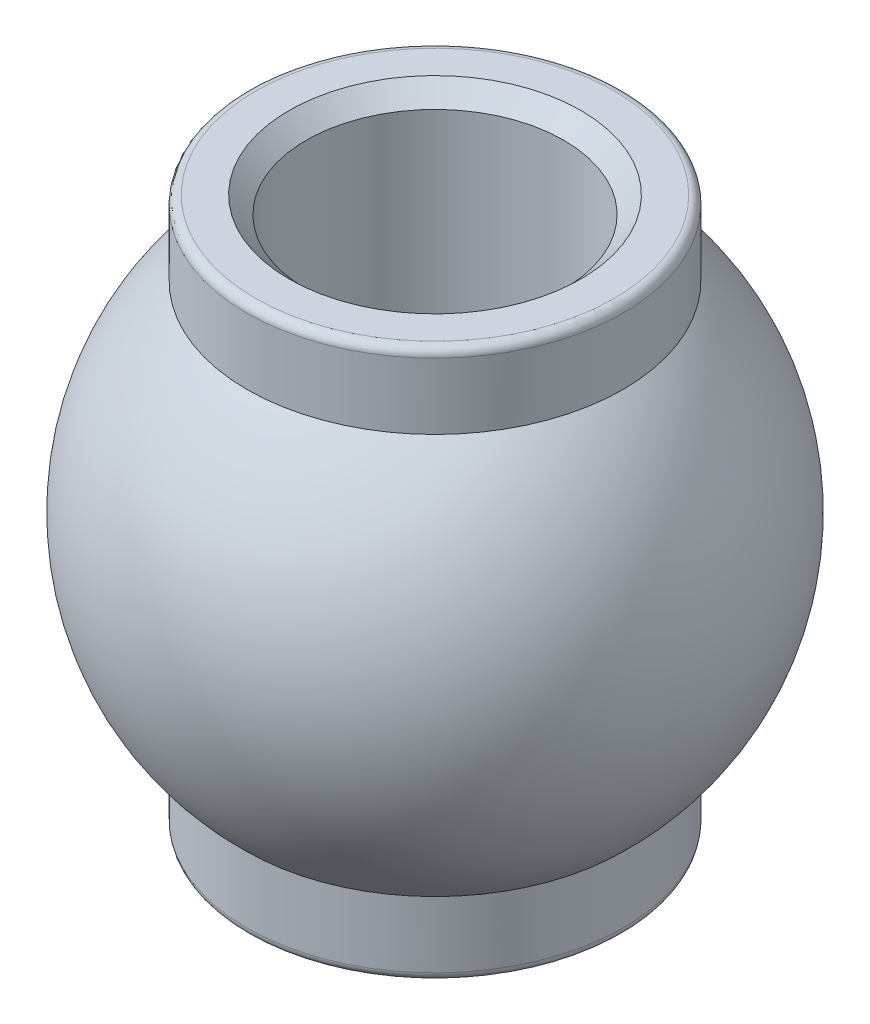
ISO-10303-21;
HEADER;
FILE_DESCRIPTION(('STEP AP214'),'2;1');
FILE_NAME('part.step','',(''),(''),'','','');
FILE_SCHEMA(('AUTOMOTIVE_DESIGN { 1 0 10303 214 1 1 1 1 }'));
ENDSEC;
DATA;
#1=APPLICATION_CONTEXT('core data for automotive mechanical design processes');
#2=APPLICATION_PROTOCOL_DEFINITION('international standard','automotive_design',2000,#1);
#3=PRODUCT_CONTEXT('',#1,'mechanical');
#4=PRODUCT('Part','Part','',(#3));
#5=PRODUCT_RELATED_PRODUCT_CATEGORY('part','',(#4));
#6=PRODUCT_DEFINITION_FORMATION('','',#4);
#7=PRODUCT_DEFINITION_CONTEXT('part definition',#1,'design');
#8=PRODUCT_DEFINITION('design','',#6,#7);
#9=PRODUCT_DEFINITION_SHAPE('','',#8);
#10=(LENGTH_UNIT() NAMED_UNIT(*) SI_UNIT(.MILLI.,.METRE.));
#11=(NAMED_UNIT(*) PLANE_ANGLE_UNIT() SI_UNIT($,.RADIAN.));
#12=(NAMED_UNIT(*) SI_UNIT($,.STERADIAN.) SOLID_ANGLE_UNIT());
#13=UNCERTAINTY_MEASURE_WITH_UNIT(LENGTH_MEASURE(1.E-05),#10,'distance_accuracy_value','');
#14=(GEOMETRIC_REPRESENTATION_CONTEXT(3) GLOBAL_UNCERTAINTY_ASSIGNED_CONTEXT((#13)) GLOBAL_UNIT_ASSIGNED_CONTEXT((#10,
#11,#12)) REPRESENTATION_CONTEXT('',''));
#15=CARTESIAN_POINT('',(0.,0.,0.));
#16=DIRECTION('',(0.,0.,1.));
#17=DIRECTION('',(1.,0.,0.));
#18=AXIS2_PLACEMENT_3D('',#15,#16,#17);
#19=CARTESIAN_POINT('',(7.50000000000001,-16.,0.));
#20=DIRECTION('',(0.,1.,0.));
#21=DIRECTION('',(0.,0.,1.));
#22=AXIS2_PLACEMENT_3D('',#19,#20,#21);
#23=PLANE('',#22);
#24=CARTESIAN_POINT('',(0.,-16.,0.));
#25=DIRECTION('',(0.,1.,0.));
#26=DIRECTION('',(0.,0.,1.));
#27=AXIS2_PLACEMENT_3D('',#24,#25,#26);
#28=CIRCLE('',#27,8.50000000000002);
#29=CARTESIAN_POINT('',(0.,-16.,8.50000000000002));
#30=VERTEX_POINT('',#29);
#31=EDGE_CURVE('E10',#30,#30,#28,.T.);
#32=ORIENTED_EDGE('',*,*,#31,.T.);
#33=EDGE_LOOP('',(#32));
#34=FACE_BOUND('',#33,.T.);
#35=CARTESIAN_POINT('',(0.,-16.,0.));
#36=DIRECTION('',(0.,1.,0.));
#37=DIRECTION('',(0.,0.,1.));
#38=AXIS2_PLACEMENT_3D('',#35,#36,#37);
#39=CIRCLE('',#38,10.45);
#40=CARTESIAN_POINT('',(0.,-16.,10.45));
#41=VERTEX_POINT('',#40);
#42=EDGE_CURVE('E61',#41,#41,#39,.T.);
#43=ORIENTED_EDGE('',*,*,#42,.F.);
#44=EDGE_LOOP('',(#43));
#45=FACE_BOUND('',#44,.T.);
#46=ADVANCED_FACE('F27',(#34,#45),#23,.F.);
#47=CARTESIAN_POINT('',(0.,27.,0.));
#48=DIRECTION('',(0.,1.,0.));
#49=DIRECTION('',(0.,0.,1.));
#50=AXIS2_PLACEMENT_3D('',#47,#48,#49);
#51=CYLINDRICAL_SURFACE('',#50,7.5);
#52=CARTESIAN_POINT('',(0.,15.,0.));
#53=DIRECTION('',(0.,-1.,0.));
#54=DIRECTION('',(0.,0.,-1.));
#55=AXIS2_PLACEMENT_3D('',#52,#53,#54);
#56=CIRCLE('',#55,7.5);
#57=CARTESIAN_POINT('',(0.,15.,-7.5));
#58=VERTEX_POINT('',#57);
#59=EDGE_CURVE('E37',#58,#58,#56,.F.);
#60=ORIENTED_EDGE('',*,*,#59,.T.);
#61=EDGE_LOOP('',(#60));
#62=FACE_BOUND('',#61,.T.);
#63=CARTESIAN_POINT('',(0.,-15.,0.));
#64=DIRECTION('',(0.,1.,0.));
#65=DIRECTION('',(0.,0.,1.));
#66=AXIS2_PLACEMENT_3D('',#63,#64,#65);
#67=CIRCLE('',#66,7.5);
#68=CARTESIAN_POINT('',(0.,-15.,7.5));
#69=VERTEX_POINT('',#68);
#70=EDGE_CURVE('E41',#69,#69,#67,.F.);
#71=ORIENTED_EDGE('',*,*,#70,.T.);
#72=EDGE_LOOP('',(#71));
#73=FACE_BOUND('',#72,.T.);
#74=ADVANCED_FACE('F68',(#62,#73),#51,.F.);
#75=CARTESIAN_POINT('',(7.5,16.,0.));
#76=DIRECTION('',(0.,-1.,0.));
#77=DIRECTION('',(0.,0.,-1.));
#78=AXIS2_PLACEMENT_3D('',#75,#76,#77);
#79=PLANE('',#78);
#80=CARTESIAN_POINT('',(0.,16.,0.));
#81=DIRECTION('',(0.,-1.,0.));
#82=DIRECTION('',(0.,0.,-1.));
#83=AXIS2_PLACEMENT_3D('',#80,#81,#82);
#84=CIRCLE('',#83,8.50000000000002);
#85=CARTESIAN_POINT('',(0.,16.,-8.50000000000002));
#86=VERTEX_POINT('',#85);
#87=EDGE_CURVE('E33',#86,#86,#84,.T.);
#88=ORIENTED_EDGE('',*,*,#87,.T.);
#89=EDGE_LOOP('',(#88));
#90=FACE_BOUND('',#89,.T.);
#91=CARTESIAN_POINT('',(0.,16.,0.));
#92=DIRECTION('',(0.,1.,0.));
#93=DIRECTION('',(0.,0.,1.));
#94=AXIS2_PLACEMENT_3D('',#91,#92,#93);
#95=CIRCLE('',#94,10.45);
#96=CARTESIAN_POINT('',(0.,16.,10.45));
#97=VERTEX_POINT('',#96);
#98=EDGE_CURVE('E46',#97,#97,#95,.T.);
#99=ORIENTED_EDGE('',*,*,#98,.T.);
#100=EDGE_LOOP('',(#99));
#101=FACE_BOUND('',#100,.T.);
#102=ADVANCED_FACE('F72',(#90,#101),#79,.F.);
#103=CARTESIAN_POINT('',(0.,15.5,0.));
#104=DIRECTION('',(0.,1.,0.));
#105=DIRECTION('',(0.,0.,1.));
#106=AXIS2_PLACEMENT_3D('',#103,#104,#105);
#107=TOROIDAL_SURFACE('',#106,10.45,0.5);
#108=ORIENTED_EDGE('',*,*,#98,.F.);
#109=EDGE_LOOP('',(#108));
#110=FACE_BOUND('',#109,.T.);
#111=CARTESIAN_POINT('',(0.,15.5,0.));
#112=DIRECTION('',(0.,1.,0.));
#113=DIRECTION('',(0.,0.,1.));
#114=AXIS2_PLACEMENT_3D('',#111,#112,#113);
#115=CIRCLE('',#114,10.95);
#116=CARTESIAN_POINT('',(0.,15.5,10.95));
#117=VERTEX_POINT('',#116);
#118=EDGE_CURVE('E49',#117,#117,#115,.T.);
#119=ORIENTED_EDGE('',*,*,#118,.T.);
#120=EDGE_LOOP('',(#119));
#121=FACE_BOUND('',#120,.T.);
#122=ADVANCED_FACE('F77',(#110,#121),#107,.T.);
#123=CARTESIAN_POINT('',(0.,27.,0.));
#124=DIRECTION('',(0.,1.,0.));
#125=DIRECTION('',(0.,0.,1.));
#126=AXIS2_PLACEMENT_3D('',#123,#124,#125);
#127=CYLINDRICAL_SURFACE('',#126,10.95);
#128=ORIENTED_EDGE('',*,*,#118,.F.);
#129=EDGE_LOOP('',(#128));
#130=FACE_BOUND('',#129,.T.);
#131=CARTESIAN_POINT('',(0.,11.6523645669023,0.));
#132=DIRECTION('',(0.,1.,0.));
#133=DIRECTION('',(0.,0.,1.));
#134=AXIS2_PLACEMENT_3D('',#131,#132,#133);
#135=CIRCLE('',#134,10.95);
#136=CARTESIAN_POINT('',(10.95,11.6523645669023,0.));
#137=VERTEX_POINT('',#136);
#138=EDGE_CURVE('E52',#137,#137,#135,.T.);
#139=ORIENTED_EDGE('',*,*,#138,.T.);
#140=EDGE_LOOP('',(#139));
#141=FACE_BOUND('',#140,.T.);
#142=ADVANCED_FACE('F83',(#130,#141),#127,.T.);
#143=CARTESIAN_POINT('',(0.,0.,0.));
#144=DIRECTION('',(0.,1.,0.));
#145=DIRECTION('',(1.,0.,0.));
#146=AXIS2_PLACEMENT_3D('',#143,#144,#145);
#147=SPHERICAL_SURFACE('',#146,15.99);
#148=CARTESIAN_POINT('',(0.,-11.6523645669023,0.));
#149=DIRECTION('',(0.,1.,0.));
#150=DIRECTION('',(0.,0.,1.));
#151=AXIS2_PLACEMENT_3D('',#148,#149,#150);
#152=CIRCLE('',#151,10.95);
#153=CARTESIAN_POINT('',(10.95,-11.6523645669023,0.));
#154=VERTEX_POINT('',#153);
#155=EDGE_CURVE('E55',#154,#154,#152,.T.);
#156=CARTESIAN_POINT('',(10.95,11.6523645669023,0.));
#157=CARTESIAN_POINT('',(11.1482072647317,11.4661134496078,0.));
#158=CARTESIAN_POINT('',(11.3416531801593,11.2747964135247,0.));
#159=CARTESIAN_POINT('',(11.7185392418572,10.8825483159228,0.));
#160=CARTESIAN_POINT('',(11.9019793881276,10.681617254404,0.));
#161=CARTESIAN_POINT('',(12.2583708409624,10.2706589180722,0.));
#162=CARTESIAN_POINT('',(12.4313221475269,10.0606316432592,0.));
#163=CARTESIAN_POINT('',(12.7662871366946,9.63202907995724,0.));
#164=CARTESIAN_POINT('',(12.9283008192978,9.41345379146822,0.));
#165=CARTESIAN_POINT('',(13.2409683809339,8.96832385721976,0.));
#166=CARTESIAN_POINT('',(13.3916222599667,8.74176921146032,0.));
#167=CARTESIAN_POINT('',(13.6811781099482,8.28127047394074,0.));
#168=CARTESIAN_POINT('',(13.8200800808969,8.04732638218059,0.));
#169=CARTESIAN_POINT('',(14.0857704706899,7.57265777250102,0.));
#170=CARTESIAN_POINT('',(14.2125588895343,7.3319332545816,0.));
#171=CARTESIAN_POINT('',(14.4536921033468,6.84433049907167,0.));
#172=CARTESIAN_POINT('',(14.5680368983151,6.59745226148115,0.));
#173=CARTESIAN_POINT('',(14.7839851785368,6.09818478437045,0.));
#174=CARTESIAN_POINT('',(14.8855886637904,5.84579554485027,0.));
#175=CARTESIAN_POINT('',(15.0757898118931,5.33616313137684,0.));
#176=CARTESIAN_POINT('',(15.1643874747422,5.07891995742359,0.));
#177=CARTESIAN_POINT('',(15.3283463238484,4.56024937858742,0.));
#178=CARTESIAN_POINT('',(15.4037075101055,4.2988219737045,0.));
#179=CARTESIAN_POINT('',(15.5409972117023,3.77246352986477,0.));
#180=CARTESIAN_POINT('',(15.6029257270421,3.50753249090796,0.));
#181=CARTESIAN_POINT('',(15.7131888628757,2.97485649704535,0.));
#182=CARTESIAN_POINT('',(15.7615234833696,2.70711154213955,0.));
#183=CARTESIAN_POINT('',(15.8444729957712,2.16950476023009,0.));
#184=CARTESIAN_POINT('',(15.8790878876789,1.89964293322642,0.));
#185=CARTESIAN_POINT('',(15.9345078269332,1.35850496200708,0.));
#186=CARTESIAN_POINT('',(15.9553128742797,1.08722881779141,0.));
#187=CARTESIAN_POINT('',(15.9830589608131,0.543968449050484,0.));
#188=CARTESIAN_POINT('',(15.99,0.271984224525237,0.));
#189=CARTESIAN_POINT('',(15.99,-0.271984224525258,0.));
#190=CARTESIAN_POINT('',(15.9830589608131,-0.543968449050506,0.));
#191=CARTESIAN_POINT('',(15.9553128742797,-1.08722881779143,0.));
#192=CARTESIAN_POINT('',(15.9345078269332,-1.3585049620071,0.));
#193=CARTESIAN_POINT('',(15.8790878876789,-1.89964293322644,0.));
#194=CARTESIAN_POINT('',(15.8444729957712,-2.16950476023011,0.));
#195=CARTESIAN_POINT('',(15.7615234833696,-2.70711154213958,0.));
#196=CARTESIAN_POINT('',(15.7131888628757,-2.97485649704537,0.));
#197=CARTESIAN_POINT('',(15.6029257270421,-3.50753249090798,0.));
#198=CARTESIAN_POINT('',(15.5409972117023,-3.77246352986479,0.));
#199=CARTESIAN_POINT('',(15.4037075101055,-4.29882197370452,0.));
#200=CARTESIAN_POINT('',(15.3283463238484,-4.56024937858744,0.));
#201=CARTESIAN_POINT('',(15.1643874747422,-5.07891995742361,0.));
#202=CARTESIAN_POINT('',(15.0757898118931,-5.33616313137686,0.));
#203=CARTESIAN_POINT('',(14.8855886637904,-5.84579554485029,0.));
#204=CARTESIAN_POINT('',(14.7839851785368,-6.09818478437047,0.));
#205=CARTESIAN_POINT('',(14.568036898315,-6.59745226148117,0.));
#206=CARTESIAN_POINT('',(14.4536921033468,-6.84433049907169,0.));
#207=CARTESIAN_POINT('',(14.2125588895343,-7.33193325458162,0.));
#208=CARTESIAN_POINT('',(14.0857704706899,-7.57265777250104,0.));
#209=CARTESIAN_POINT('',(13.8200800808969,-8.04732638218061,0.));
#210=CARTESIAN_POINT('',(13.6811781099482,-8.28127047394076,0.));
#211=CARTESIAN_POINT('',(13.3916222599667,-8.74176921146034,0.));
#212=CARTESIAN_POINT('',(13.2409683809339,-8.96832385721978,0.));
#213=CARTESIAN_POINT('',(12.9283008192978,-9.41345379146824,0.));
#214=CARTESIAN_POINT('',(12.7662871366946,-9.63202907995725,0.));
#215=CARTESIAN_POINT('',(12.4313221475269,-10.0606316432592,0.));
#216=CARTESIAN_POINT('',(12.2583708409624,-10.2706589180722,0.));
#217=CARTESIAN_POINT('',(11.9019793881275,-10.681617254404,0.));
#218=CARTESIAN_POINT('',(11.7185392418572,-10.8825483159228,0.));
#219=CARTESIAN_POINT('',(11.3416531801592,-11.2747964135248,0.));
#220=CARTESIAN_POINT('',(11.1482072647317,-11.4661134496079,0.));
#221=CARTESIAN_POINT('',(10.95,-11.6523645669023,0.));
#222=B_SPLINE_CURVE_WITH_KNOTS('',3,(#156,#157,#158,#159,#160,#161,#162,#163,#164,#165,#166,
#167,#168,#169,#170,#171,#172,#173,#174,#175,#176,#177,#178,#179,#180,#181,#182,#183,#184,#185,
#186,#187,#188,#189,#190,#191,#192,#193,#194,#195,#196,#197,#198,#199,#200,#201,#202,#203,#204,
#205,#206,#207,#208,#209,#210,#211,#212,#213,#214,#215,#216,#217,#218,#219,#220,#221),
.UNSPECIFIED.,.F.,.F.,(4,2,2,2,2,2,2,2,2,2,2,2,2,2,2,2,2,2,2,2,2,2,2,2,2,2,2,2,2,2,2,2,4),(0.,
0.815864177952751,1.6317283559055,2.44759253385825,3.263456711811,4.07932088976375,
4.8951850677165,5.71104924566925,6.526913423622,7.34277760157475,8.1586417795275,
8.97450595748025,9.790370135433,10.6062343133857,11.4220984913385,12.2379626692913,
13.053826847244,13.8696910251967,14.6855552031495,15.5014193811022,16.317283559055,
17.1331477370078,17.9490119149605,18.7648760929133,19.580740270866,20.3966044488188,
21.2124686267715,22.0283328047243,22.844196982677,23.6600611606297,24.4759253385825,
25.2917895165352,26.107653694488),.UNSPECIFIED.);
#223=EDGE_CURVE('BSEAM87',#137,#154,#222,.T.);
#224=ORIENTED_EDGE('',*,*,#138,.F.);
#225=ORIENTED_EDGE('',*,*,#155,.T.);
#226=ORIENTED_EDGE('',*,*,#223,.T.);
#227=ORIENTED_EDGE('',*,*,#223,.F.);
#228=EDGE_LOOP('',(#224,#226,#225,#227));
#229=FACE_BOUND('',#228,.T.);
#230=ADVANCED_FACE('F87',(#229),#147,.T.);
#231=CARTESIAN_POINT('',(0.,27.,0.));
#232=DIRECTION('',(0.,1.,0.));
#233=DIRECTION('',(0.,0.,1.));
#234=AXIS2_PLACEMENT_3D('',#231,#232,#233);
#235=CYLINDRICAL_SURFACE('',#234,10.95);
#236=ORIENTED_EDGE('',*,*,#155,.F.);
#237=EDGE_LOOP('',(#236));
#238=FACE_BOUND('',#237,.T.);
#239=CARTESIAN_POINT('',(0.,-15.5,0.));
#240=DIRECTION('',(0.,1.,0.));
#241=DIRECTION('',(0.,0.,1.));
#242=AXIS2_PLACEMENT_3D('',#239,#240,#241);
#243=CIRCLE('',#242,10.95);
#244=CARTESIAN_POINT('',(0.,-15.5,10.95));
#245=VERTEX_POINT('',#244);
#246=EDGE_CURVE('E58',#245,#245,#243,.T.);
#247=ORIENTED_EDGE('',*,*,#246,.T.);
#248=EDGE_LOOP('',(#247));
#249=FACE_BOUND('',#248,.T.);
#250=ADVANCED_FACE('F91',(#238,#249),#235,.T.);
#251=CARTESIAN_POINT('',(0.,-15.5,0.));
#252=DIRECTION('',(0.,1.,0.));
#253=DIRECTION('',(0.,0.,1.));
#254=AXIS2_PLACEMENT_3D('',#251,#252,#253);
#255=TOROIDAL_SURFACE('',#254,10.45,0.499999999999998);
#256=ORIENTED_EDGE('',*,*,#246,.F.);
#257=EDGE_LOOP('',(#256));
#258=FACE_BOUND('',#257,.T.);
#259=ORIENTED_EDGE('',*,*,#42,.T.);
#260=EDGE_LOOP('',(#259));
#261=FACE_BOUND('',#260,.T.);
#262=ADVANCED_FACE('F65',(#258,#261),#255,.T.);
#263=CARTESIAN_POINT('',(0.,15.,0.));
#264=DIRECTION('',(0.,1.,0.));
#265=DIRECTION('',(0.,0.,1.));
#266=AXIS2_PLACEMENT_3D('',#263,#264,#265);
#267=CONICAL_SURFACE('',#266,7.5,0.785398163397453);
#268=ORIENTED_EDGE('',*,*,#87,.F.);
#269=EDGE_LOOP('',(#268));
#270=FACE_BOUND('',#269,.T.);
#271=ORIENTED_EDGE('',*,*,#59,.F.);
#272=EDGE_LOOP('',(#271));
#273=FACE_BOUND('',#272,.T.);
#274=ADVANCED_FACE('F98',(#270,#273),#267,.F.);
#275=CARTESIAN_POINT('',(0.,-16.,0.));
#276=DIRECTION('',(0.,-1.,0.));
#277=DIRECTION('',(0.,0.,-1.));
#278=AXIS2_PLACEMENT_3D('',#275,#276,#277);
#279=CONICAL_SURFACE('',#278,8.50000000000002,0.785398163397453);
#280=ORIENTED_EDGE('',*,*,#70,.F.);
#281=EDGE_LOOP('',(#280));
#282=FACE_BOUND('',#281,.T.);
#283=ORIENTED_EDGE('',*,*,#31,.F.);
#284=EDGE_LOOP('',(#283));
#285=FACE_BOUND('',#284,.T.);
#286=ADVANCED_FACE('F102',(#282,#285),#279,.F.);
#287=CLOSED_SHELL('',(#46,#74,#102,#122,#142,#230,#250,#262,#274,#286));
#288=MANIFOLD_SOLID_BREP('B2',#287);
#289=ADVANCED_BREP_SHAPE_REPRESENTATION('',(#18,#288),#14);
#290=SHAPE_DEFINITION_REPRESENTATION(#9,#289);
ENDSEC;
END-ISO-10303-21;
